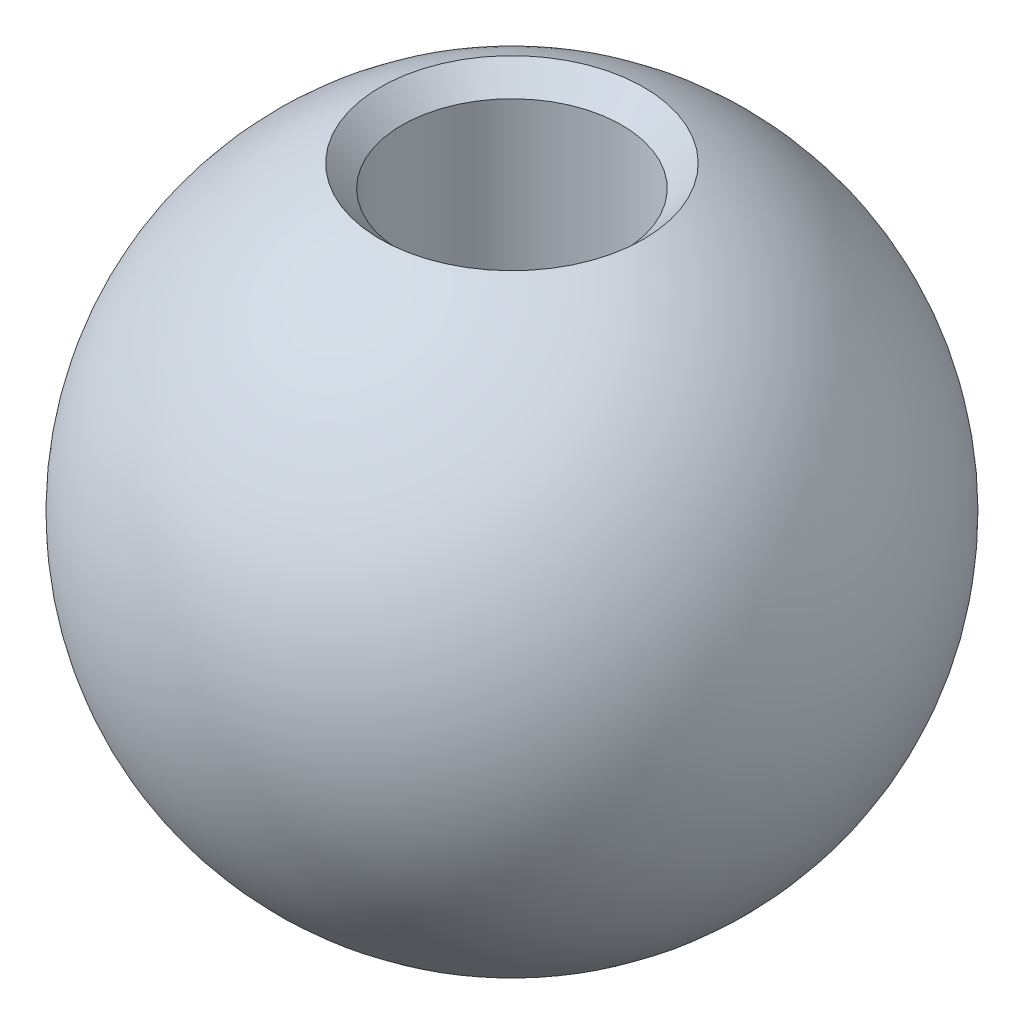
from build123d import *


with BuildPart() as part:
    # Sketch2 → Revolve1 (revolve)
    with BuildSketch(Plane.XY):
        with BuildLine():
            Line((2, -5.5), (2.397915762, -5.5))
            ThreePointArc((2.397915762, -5.5), (6, 0), (2.397915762, 5.5))
            Line((2.397915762, 5.5), (2, 5.102084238))
            Line((2, 5.102084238), (2, -5.5))
        make_face()
    revolve(axis=Axis((0, -5.5, 0), (0, 1, 0)))


solid = part.part
